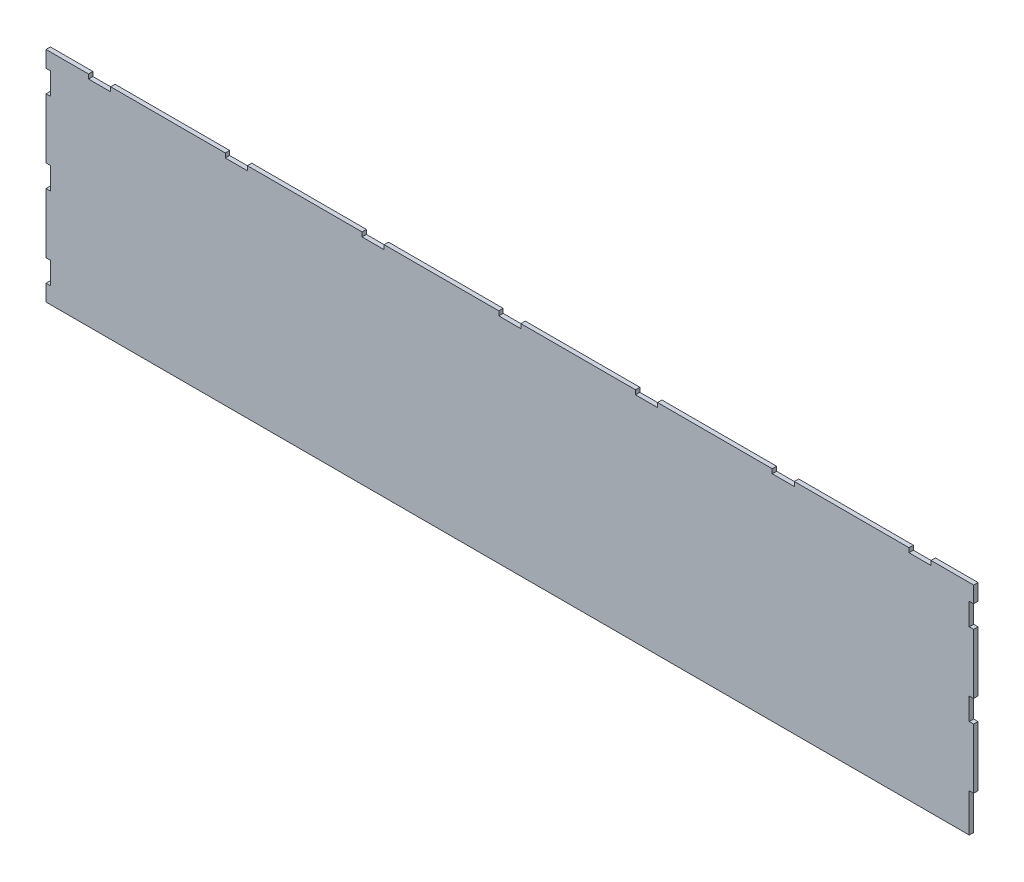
from build123d import *

# Parameters (mm, degrees)
SKIZZE1_W                       = 848
SKIZZE1_H                       = 200
AUFSATZ_LINEAR_AUSTRAGEN1_DEPTH = 4
SKIZZE2_W                       = 4
SKIZZE2_H                       = 20.2
SKIZZE2_H_2                     = 35.1
SKIZZE2_W_2                     = 20.2
SKIZZE2_H_3                     = 4
SCHNITT_LINEAR_AUSTRAGEN1_DEPTH = 436.651236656


with BuildPart() as part:
    # Skizze1 → Aufsatz-Linear austragen1 (new body)
    with BuildSketch(Plane.XY):
        Rectangle(SKIZZE1_W, SKIZZE1_H)
    extrude(amount=AUFSATZ_LINEAR_AUSTRAGEN1_DEPTH)

    # Skizze2 → Schnitt-Linear austragen1 (cut, through all)
    with BuildSketch(Plane.XY.offset(4)):
        with Locations((-422, -75)):
            Rectangle(SKIZZE2_W, SKIZZE2_H)
        with Locations((-422, 0)):
            Rectangle(SKIZZE2_W, SKIZZE2_H)
        with Locations((-422, 75)):
            Rectangle(SKIZZE2_W, SKIZZE2_H)
        with Locations((422, 75)):
            Rectangle(SKIZZE2_W, SKIZZE2_H)
        with Locations((422, 0)):
            Rectangle(SKIZZE2_W, SKIZZE2_H)
        with Locations((422, -82.45)):
            Rectangle(SKIZZE2_W, SKIZZE2_H_2)
        with Locations((-375, 98)):
            Rectangle(SKIZZE2_W_2, SKIZZE2_H_3)
        with Locations((-250, 98)):
            Rectangle(SKIZZE2_W_2, SKIZZE2_H_3)
        with Locations((-125, 98)):
            Rectangle(SKIZZE2_W_2, SKIZZE2_H_3)
        with Locations((0, 98)):
            Rectangle(SKIZZE2_W_2, SKIZZE2_H_3)
        with Locations((125, 98)):
            Rectangle(SKIZZE2_W_2, SKIZZE2_H_3)
        with Locations((250, 98)):
            Rectangle(SKIZZE2_W_2, SKIZZE2_H_3)
        with Locations((375, 98)):
            Rectangle(SKIZZE2_W_2, SKIZZE2_H_3)
    extrude(amount=-SCHNITT_LINEAR_AUSTRAGEN1_DEPTH, mode=Mode.SUBTRACT)


solid = part.part
